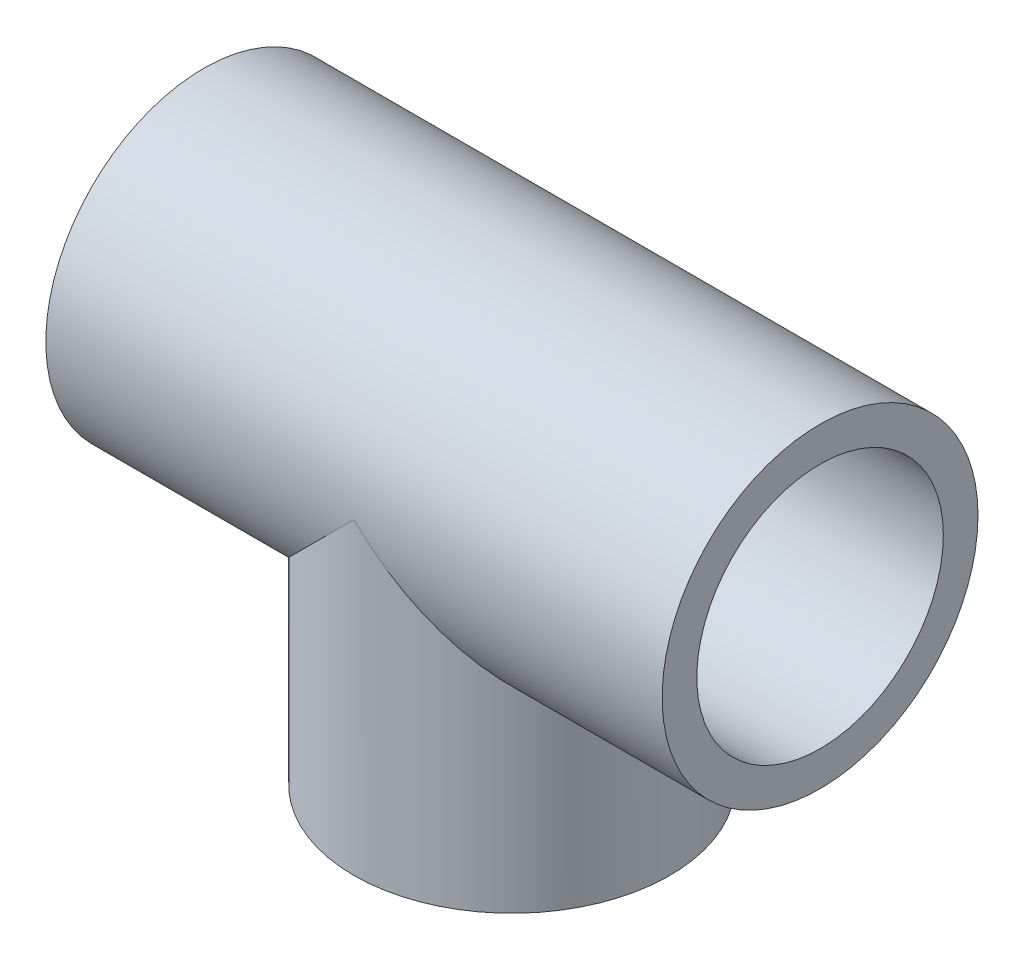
ISO-10303-21;
HEADER;
FILE_DESCRIPTION(('STEP AP214'),'2;1');
FILE_NAME('part.step','',(''),(''),'','','');
FILE_SCHEMA(('AUTOMOTIVE_DESIGN { 1 0 10303 214 1 1 1 1 }'));
ENDSEC;
DATA;
#1=APPLICATION_CONTEXT('core data for automotive mechanical design processes');
#2=APPLICATION_PROTOCOL_DEFINITION('international standard','automotive_design',2000,#1);
#3=PRODUCT_CONTEXT('',#1,'mechanical');
#4=PRODUCT('Part','Part','',(#3));
#5=PRODUCT_RELATED_PRODUCT_CATEGORY('part','',(#4));
#6=PRODUCT_DEFINITION_FORMATION('','',#4);
#7=PRODUCT_DEFINITION_CONTEXT('part definition',#1,'design');
#8=PRODUCT_DEFINITION('design','',#6,#7);
#9=PRODUCT_DEFINITION_SHAPE('','',#8);
#10=(LENGTH_UNIT() NAMED_UNIT(*) SI_UNIT(.MILLI.,.METRE.));
#11=(NAMED_UNIT(*) PLANE_ANGLE_UNIT() SI_UNIT($,.RADIAN.));
#12=(NAMED_UNIT(*) SI_UNIT($,.STERADIAN.) SOLID_ANGLE_UNIT());
#13=UNCERTAINTY_MEASURE_WITH_UNIT(LENGTH_MEASURE(1.E-05),#10,'distance_accuracy_value','');
#14=(GEOMETRIC_REPRESENTATION_CONTEXT(3) GLOBAL_UNCERTAINTY_ASSIGNED_CONTEXT((#13)) GLOBAL_UNIT_ASSIGNED_CONTEXT((#10,
#11,#12)) REPRESENTATION_CONTEXT('',''));
#15=CARTESIAN_POINT('',(0.,0.,0.));
#16=DIRECTION('',(0.,0.,1.));
#17=DIRECTION('',(1.,0.,0.));
#18=AXIS2_PLACEMENT_3D('',#15,#16,#17);
#19=CARTESIAN_POINT('',(40.,0.,0.));
#20=DIRECTION('',(-1.,0.,0.));
#21=DIRECTION('',(0.,0.,1.));
#22=AXIS2_PLACEMENT_3D('',#19,#20,#21);
#23=CYLINDRICAL_SURFACE('',#22,20.5);
#24=CARTESIAN_POINT('',(0.,0.,0.));
#25=DIRECTION('',(-0.707106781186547,-0.707106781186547,0.));
#26=DIRECTION('',(-0.707106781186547,0.707106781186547,0.));
#27=AXIS2_PLACEMENT_3D('',#24,#25,#26);
#28=ELLIPSE('',#27,28.9913780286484,20.5);
#29=CARTESIAN_POINT('',(0.,0.,20.5));
#30=VERTEX_POINT('',#29);
#31=CARTESIAN_POINT('',(0.,0.,-20.5));
#32=VERTEX_POINT('',#31);
#33=EDGE_CURVE('E43',#30,#32,#28,.F.);
#34=ORIENTED_EDGE('',*,*,#33,.T.);
#35=CARTESIAN_POINT('',(0.,0.,0.));
#36=DIRECTION('',(-0.707106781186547,0.707106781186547,0.));
#37=DIRECTION('',(-0.707106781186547,-0.707106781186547,0.));
#38=AXIS2_PLACEMENT_3D('',#35,#36,#37);
#39=ELLIPSE('',#38,28.9913780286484,20.5);
#40=EDGE_CURVE('E11',#32,#30,#39,.T.);
#41=ORIENTED_EDGE('',*,*,#40,.T.);
#42=EDGE_LOOP('',(#34,#41));
#43=FACE_BOUND('',#42,.T.);
#44=CARTESIAN_POINT('',(40.,0.,0.));
#45=DIRECTION('',(1.,0.,0.));
#46=DIRECTION('',(0.,0.,-1.));
#47=AXIS2_PLACEMENT_3D('',#44,#45,#46);
#48=CIRCLE('',#47,20.5);
#49=CARTESIAN_POINT('',(40.,0.,-20.5));
#50=VERTEX_POINT('',#49);
#51=EDGE_CURVE('E72',#50,#50,#48,.T.);
#52=ORIENTED_EDGE('',*,*,#51,.F.);
#53=EDGE_LOOP('',(#52));
#54=FACE_BOUND('',#53,.T.);
#55=CARTESIAN_POINT('',(-40.,0.,0.));
#56=DIRECTION('',(1.,0.,0.));
#57=DIRECTION('',(0.,0.,-1.));
#58=AXIS2_PLACEMENT_3D('',#55,#56,#57);
#59=CIRCLE('',#58,20.5);
#60=CARTESIAN_POINT('',(-40.,0.,-20.5));
#61=VERTEX_POINT('',#60);
#62=EDGE_CURVE('E69',#61,#61,#59,.T.);
#63=ORIENTED_EDGE('',*,*,#62,.T.);
#64=EDGE_LOOP('',(#63));
#65=FACE_BOUND('',#64,.T.);
#66=ADVANCED_FACE('F34',(#43,#54,#65),#23,.T.);
#67=CARTESIAN_POINT('',(40.,0.,0.));
#68=DIRECTION('',(1.,0.,0.));
#69=DIRECTION('',(0.,0.,-1.));
#70=AXIS2_PLACEMENT_3D('',#67,#68,#69);
#71=PLANE('',#70);
#72=CARTESIAN_POINT('',(40.,0.,0.));
#73=DIRECTION('',(1.,0.,0.));
#74=DIRECTION('',(0.,0.,-1.));
#75=AXIS2_PLACEMENT_3D('',#72,#73,#74);
#76=CIRCLE('',#75,16.);
#77=CARTESIAN_POINT('',(40.,0.,-16.));
#78=VERTEX_POINT('',#77);
#79=EDGE_CURVE('E64',#78,#78,#76,.T.);
#80=ORIENTED_EDGE('',*,*,#79,.F.);
#81=EDGE_LOOP('',(#80));
#82=FACE_BOUND('',#81,.T.);
#83=ORIENTED_EDGE('',*,*,#51,.T.);
#84=EDGE_LOOP('',(#83));
#85=FACE_BOUND('',#84,.T.);
#86=ADVANCED_FACE('F81',(#82,#85),#71,.T.);
#87=CARTESIAN_POINT('',(-40.,0.,0.));
#88=DIRECTION('',(1.,0.,0.));
#89=DIRECTION('',(0.,0.,-1.));
#90=AXIS2_PLACEMENT_3D('',#87,#88,#89);
#91=PLANE('',#90);
#92=CARTESIAN_POINT('',(-40.,0.,0.));
#93=DIRECTION('',(1.,0.,0.));
#94=DIRECTION('',(0.,0.,-1.));
#95=AXIS2_PLACEMENT_3D('',#92,#93,#94);
#96=CIRCLE('',#95,16.);
#97=CARTESIAN_POINT('',(-40.,0.,-16.));
#98=VERTEX_POINT('',#97);
#99=EDGE_CURVE('E149',#98,#98,#96,.T.);
#100=ORIENTED_EDGE('',*,*,#99,.T.);
#101=EDGE_LOOP('',(#100));
#102=FACE_BOUND('',#101,.T.);
#103=ORIENTED_EDGE('',*,*,#62,.F.);
#104=EDGE_LOOP('',(#103));
#105=FACE_BOUND('',#104,.T.);
#106=ADVANCED_FACE('F79',(#102,#105),#91,.F.);
#107=CARTESIAN_POINT('',(0.,-40.,0.));
#108=DIRECTION('',(0.,1.,0.));
#109=DIRECTION('',(0.,0.,1.));
#110=AXIS2_PLACEMENT_3D('',#107,#108,#109);
#111=CYLINDRICAL_SURFACE('',#110,20.5);
#112=CARTESIAN_POINT('',(0.,-40.,0.));
#113=DIRECTION('',(0.,1.,0.));
#114=DIRECTION('',(0.,0.,1.));
#115=AXIS2_PLACEMENT_3D('',#112,#113,#114);
#116=CIRCLE('',#115,20.5);
#117=CARTESIAN_POINT('',(0.,-40.,20.5));
#118=VERTEX_POINT('',#117);
#119=EDGE_CURVE('E38',#118,#118,#116,.T.);
#120=ORIENTED_EDGE('',*,*,#119,.T.);
#121=EDGE_LOOP('',(#120));
#122=FACE_BOUND('',#121,.T.);
#123=ORIENTED_EDGE('',*,*,#40,.F.);
#124=ORIENTED_EDGE('',*,*,#33,.F.);
#125=EDGE_LOOP('',(#123,#124));
#126=FACE_BOUND('',#125,.T.);
#127=ADVANCED_FACE('F36',(#122,#126),#111,.T.);
#128=CARTESIAN_POINT('',(0.,-40.,0.));
#129=DIRECTION('',(0.,1.,0.));
#130=DIRECTION('',(0.,0.,1.));
#131=AXIS2_PLACEMENT_3D('',#128,#129,#130);
#132=PLANE('',#131);
#133=CARTESIAN_POINT('',(0.,-40.,0.));
#134=DIRECTION('',(0.,1.,0.));
#135=DIRECTION('',(0.,0.,1.));
#136=AXIS2_PLACEMENT_3D('',#133,#134,#135);
#137=CIRCLE('',#136,16.);
#138=CARTESIAN_POINT('',(0.,-40.,16.));
#139=VERTEX_POINT('',#138);
#140=EDGE_CURVE('E148',#139,#139,#137,.T.);
#141=ORIENTED_EDGE('',*,*,#140,.T.);
#142=EDGE_LOOP('',(#141));
#143=FACE_BOUND('',#142,.T.);
#144=ORIENTED_EDGE('',*,*,#119,.F.);
#145=EDGE_LOOP('',(#144));
#146=FACE_BOUND('',#145,.T.);
#147=ADVANCED_FACE('F88',(#143,#146),#132,.F.);
#148=CARTESIAN_POINT('',(40.,0.,0.));
#149=DIRECTION('',(-1.,0.,0.));
#150=DIRECTION('',(0.,0.,1.));
#151=AXIS2_PLACEMENT_3D('',#148,#149,#150);
#152=CYLINDRICAL_SURFACE('',#151,16.);
#153=CARTESIAN_POINT('',(0.,0.,0.));
#154=DIRECTION('',(-0.707106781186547,-0.707106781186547,0.));
#155=DIRECTION('',(-0.707106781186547,0.707106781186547,0.));
#156=AXIS2_PLACEMENT_3D('',#153,#154,#155);
#157=ELLIPSE('',#156,22.6274169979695,16.);
#158=CARTESIAN_POINT('',(0.,0.,16.));
#159=VERTEX_POINT('',#158);
#160=CARTESIAN_POINT('',(0.,0.,-16.));
#161=VERTEX_POINT('',#160);
#162=EDGE_CURVE('E58',#159,#161,#157,.F.);
#163=ORIENTED_EDGE('',*,*,#162,.F.);
#164=CARTESIAN_POINT('',(0.,0.,0.));
#165=DIRECTION('',(-0.707106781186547,0.707106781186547,0.));
#166=DIRECTION('',(-0.707106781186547,-0.707106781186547,0.));
#167=AXIS2_PLACEMENT_3D('',#164,#165,#166);
#168=ELLIPSE('',#167,22.6274169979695,16.);
#169=EDGE_CURVE('E62',#161,#159,#168,.T.);
#170=ORIENTED_EDGE('',*,*,#169,.F.);
#171=EDGE_LOOP('',(#163,#170));
#172=FACE_BOUND('',#171,.T.);
#173=ORIENTED_EDGE('',*,*,#79,.T.);
#174=EDGE_LOOP('',(#173));
#175=FACE_BOUND('',#174,.T.);
#176=ORIENTED_EDGE('',*,*,#99,.F.);
#177=EDGE_LOOP('',(#176));
#178=FACE_BOUND('',#177,.T.);
#179=ADVANCED_FACE('F60',(#172,#175,#178),#152,.F.);
#180=CARTESIAN_POINT('',(0.,-40.,0.));
#181=DIRECTION('',(0.,1.,0.));
#182=DIRECTION('',(0.,0.,1.));
#183=AXIS2_PLACEMENT_3D('',#180,#181,#182);
#184=CYLINDRICAL_SURFACE('',#183,16.);
#185=ORIENTED_EDGE('',*,*,#140,.F.);
#186=EDGE_LOOP('',(#185));
#187=FACE_BOUND('',#186,.T.);
#188=ORIENTED_EDGE('',*,*,#169,.T.);
#189=ORIENTED_EDGE('',*,*,#162,.T.);
#190=EDGE_LOOP('',(#188,#189));
#191=FACE_BOUND('',#190,.T.);
#192=ADVANCED_FACE('F66',(#187,#191),#184,.F.);
#193=CLOSED_SHELL('',(#66,#86,#106,#127,#147,#179,#192));
#194=MANIFOLD_SOLID_BREP('B2',#193);
#195=ADVANCED_BREP_SHAPE_REPRESENTATION('',(#18,#194),#14);
#196=SHAPE_DEFINITION_REPRESENTATION(#9,#195);
ENDSEC;
END-ISO-10303-21;
